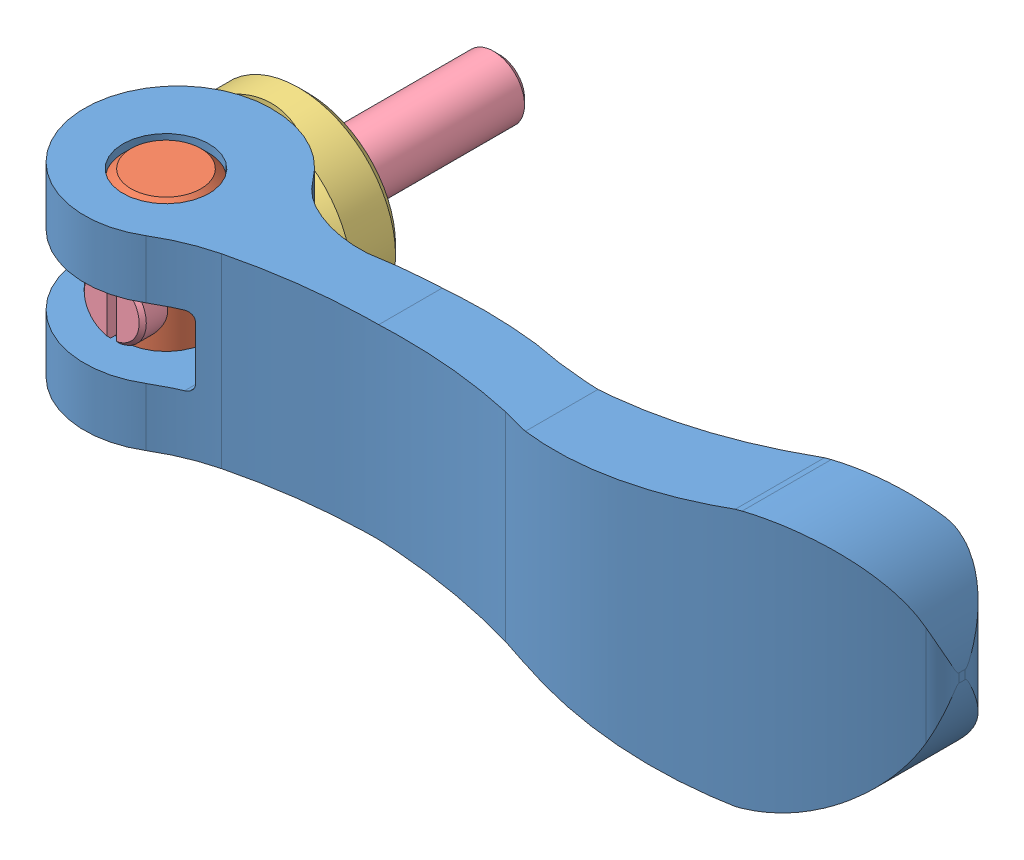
SolidWorks assembly KCL08X25-SUS.SLDASM, configuration Default (file format 15000). Lengths in mm.
Overall size (108.51 33.22 53.5).
4 component instances, 4 part files, 0 mates.
Components (placement in the parent):
- KCL08X25-SUS_01-1: KCL08X25-SUS_01.SLDPRT [ﾃﾞﾌｫﾙﾄ] at (0 0 18.3) x (1 0 0) z (0 -1 0) size (108.01 24 33.22)
- KCL08X25-SUS_02-1: KCL08X25-SUS_02.SLDPRT [ﾃﾞﾌｫﾙﾄ] at (0 0 18.3) x (0 1 0) z (1 0 0) size (24 11 11)
- KCL08X25-SUS_03-1: KCL08X25-SUS_03.SLDPRT [ﾃﾞﾌｫﾙﾄ] x (1 0 0) z (0 -1 0) size (25 8 25)
- KCL08X25-SUS_04-1: KCL08X25-SUS_04.SLDPRT [ﾃﾞﾌｫﾙﾄ] at (0 0 -24.7) x (0 1 0) z (1 0 0) size (8 50 8)
